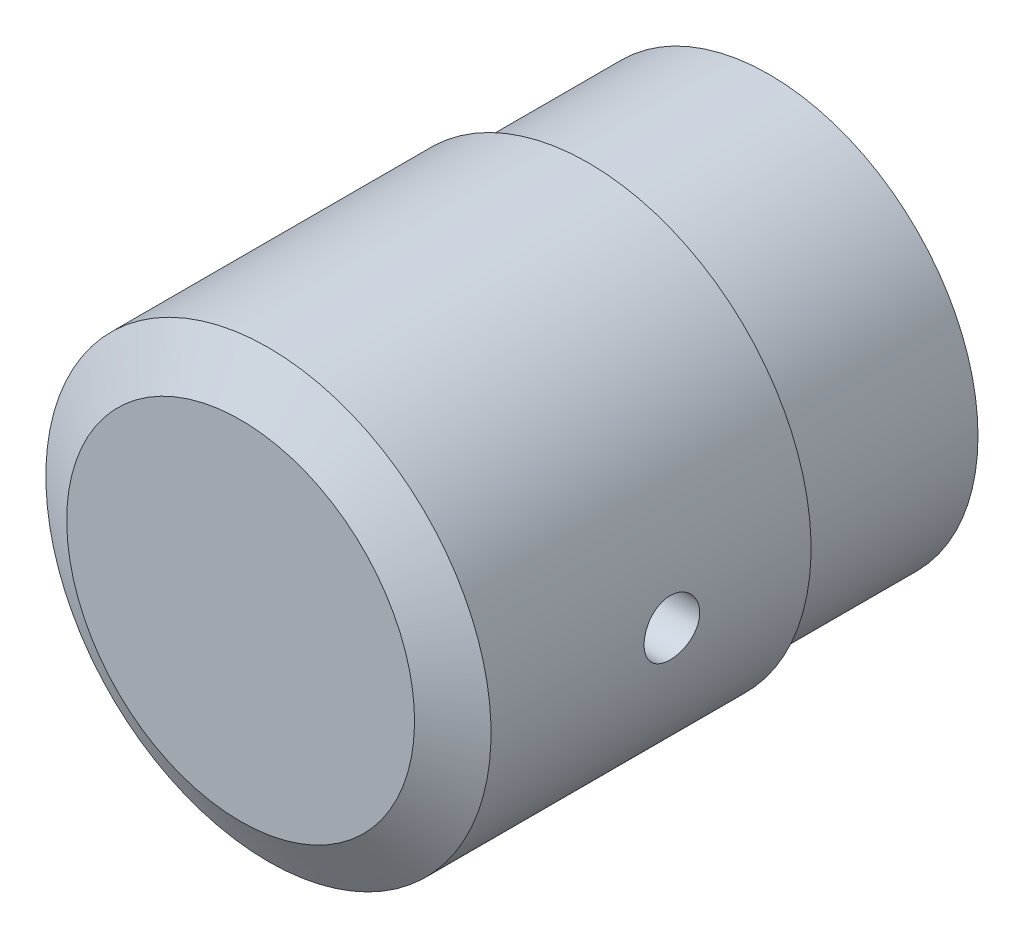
ISO-10303-21;
HEADER;
FILE_DESCRIPTION(('STEP AP214'),'2;1');
FILE_NAME('part.step','',(''),(''),'','','');
FILE_SCHEMA(('AUTOMOTIVE_DESIGN { 1 0 10303 214 1 1 1 1 }'));
ENDSEC;
DATA;
#1=APPLICATION_CONTEXT('core data for automotive mechanical design processes');
#2=APPLICATION_PROTOCOL_DEFINITION('international standard','automotive_design',2000,#1);
#3=PRODUCT_CONTEXT('',#1,'mechanical');
#4=PRODUCT('Part','Part','',(#3));
#5=PRODUCT_RELATED_PRODUCT_CATEGORY('part','',(#4));
#6=PRODUCT_DEFINITION_FORMATION('','',#4);
#7=PRODUCT_DEFINITION_CONTEXT('part definition',#1,'design');
#8=PRODUCT_DEFINITION('design','',#6,#7);
#9=PRODUCT_DEFINITION_SHAPE('','',#8);
#10=(LENGTH_UNIT() NAMED_UNIT(*) SI_UNIT(.MILLI.,.METRE.));
#11=(NAMED_UNIT(*) PLANE_ANGLE_UNIT() SI_UNIT($,.RADIAN.));
#12=(NAMED_UNIT(*) SI_UNIT($,.STERADIAN.) SOLID_ANGLE_UNIT());
#13=UNCERTAINTY_MEASURE_WITH_UNIT(LENGTH_MEASURE(1.E-05),#10,'distance_accuracy_value','');
#14=(GEOMETRIC_REPRESENTATION_CONTEXT(3) GLOBAL_UNCERTAINTY_ASSIGNED_CONTEXT((#13)) GLOBAL_UNIT_ASSIGNED_CONTEXT((#10,
#11,#12)) REPRESENTATION_CONTEXT('',''));
#15=CARTESIAN_POINT('',(0.,0.,0.));
#16=DIRECTION('',(0.,0.,1.));
#17=DIRECTION('',(1.,0.,0.));
#18=AXIS2_PLACEMENT_3D('',#15,#16,#17);
#19=CARTESIAN_POINT('',(0.,0.,0.832147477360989));
#20=DIRECTION('',(0.,0.,-1.));
#21=DIRECTION('',(0.,-1.,0.));
#22=AXIS2_PLACEMENT_3D('',#19,#20,#21);
#23=CYLINDRICAL_SURFACE('',#22,16.);
#24=CARTESIAN_POINT('',(0.,0.,13.));
#25=DIRECTION('',(0.,0.,-1.));
#26=DIRECTION('',(0.,-1.,0.));
#27=AXIS2_PLACEMENT_3D('',#24,#25,#26);
#28=CIRCLE('',#27,16.);
#29=CARTESIAN_POINT('',(0.,-16.,13.));
#30=VERTEX_POINT('',#29);
#31=EDGE_CURVE('E29',#30,#30,#28,.T.);
#32=ORIENTED_EDGE('',*,*,#31,.F.);
#33=EDGE_LOOP('',(#32));
#34=FACE_BOUND('',#33,.T.);
#35=CARTESIAN_POINT('',(0.,0.,36.));
#36=DIRECTION('',(0.,0.,-1.));
#37=DIRECTION('',(0.,-1.,0.));
#38=AXIS2_PLACEMENT_3D('',#35,#36,#37);
#39=CIRCLE('',#38,16.);
#40=CARTESIAN_POINT('',(0.,-16.,36.));
#41=VERTEX_POINT('',#40);
#42=EDGE_CURVE('E25',#41,#41,#39,.T.);
#43=ORIENTED_EDGE('',*,*,#42,.T.);
#44=EDGE_LOOP('',(#43));
#45=FACE_BOUND('',#44,.T.);
#46=CARTESIAN_POINT('',(15.8745078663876,2.,23.));
#47=CARTESIAN_POINT('',(15.8745094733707,1.99999524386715,22.8881309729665));
#48=CARTESIAN_POINT('',(15.8757031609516,1.990582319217,22.7761920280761));
#49=CARTESIAN_POINT('',(15.8803471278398,1.95318113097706,22.5554294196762));
#50=CARTESIAN_POINT('',(15.8837997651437,1.92517345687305,22.4466091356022));
#51=CARTESIAN_POINT('',(15.8925645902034,1.85142135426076,22.235312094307));
#52=CARTESIAN_POINT('',(15.8978755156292,1.80568896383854,22.1328310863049));
#53=CARTESIAN_POINT('',(15.9097569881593,1.69781135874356,21.9370172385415));
#54=CARTESIAN_POINT('',(15.9163273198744,1.63566894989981,21.8436828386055));
#55=CARTESIAN_POINT('',(15.9300284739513,1.49636276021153,21.6682702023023));
#56=CARTESIAN_POINT('',(15.9371619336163,1.41912545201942,21.5862505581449));
#57=CARTESIAN_POINT('',(15.9511618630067,1.25198020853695,21.4363017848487));
#58=CARTESIAN_POINT('',(15.9580283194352,1.1620716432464,21.3683733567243));
#59=CARTESIAN_POINT('',(15.9707475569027,0.971767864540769,21.2483251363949));
#60=CARTESIAN_POINT('',(15.9765969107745,0.871338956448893,21.1962583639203));
#61=CARTESIAN_POINT('',(15.9865938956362,0.663077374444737,21.1097510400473));
#62=CARTESIAN_POINT('',(15.9907415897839,0.55524497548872,21.0753098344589));
#63=CARTESIAN_POINT('',(15.99684934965,0.335836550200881,21.0252063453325));
#64=CARTESIAN_POINT('',(15.9988207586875,0.224283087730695,21.0094466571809));
#65=CARTESIAN_POINT('',(16.0003925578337,9.85605492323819E-05,20.9968516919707));
#66=CARTESIAN_POINT('',(15.9999930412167,-0.112532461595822,21.000015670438));
#67=CARTESIAN_POINT('',(15.9968771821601,-0.335012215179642,21.0251001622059));
#68=CARTESIAN_POINT('',(15.9941737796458,-0.444872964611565,21.0469159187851));
#69=CARTESIAN_POINT('',(15.9867684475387,-0.659361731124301,21.108520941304));
#70=CARTESIAN_POINT('',(15.9820664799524,-0.763989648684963,21.1483105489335));
#71=CARTESIAN_POINT('',(15.9711700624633,-0.965367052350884,21.2448451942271));
#72=CARTESIAN_POINT('',(15.9649716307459,-1.06209458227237,21.3016355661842));
#73=CARTESIAN_POINT('',(15.9517757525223,-1.24468596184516,21.4305266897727));
#74=CARTESIAN_POINT('',(15.9447782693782,-1.33054931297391,21.5026281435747));
#75=CARTESIAN_POINT('',(15.9307109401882,-1.48959042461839,21.6606814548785));
#76=CARTESIAN_POINT('',(15.9236409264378,-1.56267747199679,21.7467246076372));
#77=CARTESIAN_POINT('',(15.9102725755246,-1.69338628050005,21.929905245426));
#78=CARTESIAN_POINT('',(15.9039742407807,-1.75100799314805,22.0270427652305));
#79=CARTESIAN_POINT('',(15.8928624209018,-1.84915565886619,22.22973559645));
#80=CARTESIAN_POINT('',(15.888049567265,-1.88967434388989,22.3352944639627));
#81=CARTESIAN_POINT('',(15.8804659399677,-1.9523853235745,22.5517915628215));
#82=CARTESIAN_POINT('',(15.8776950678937,-1.9745785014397,22.6627295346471));
#83=CARTESIAN_POINT('',(15.8745271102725,-1.99988834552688,22.8860345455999));
#84=CARTESIAN_POINT('',(15.874114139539,-2.00313267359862,22.9983868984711));
#85=CARTESIAN_POINT('',(15.8756667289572,-1.99078956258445,23.2220335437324));
#86=CARTESIAN_POINT('',(15.8776322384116,-1.97520252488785,23.3333278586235));
#87=CARTESIAN_POINT('',(15.8837058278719,-1.92574662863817,23.5513166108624));
#88=CARTESIAN_POINT('',(15.8878066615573,-1.89193958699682,23.6580252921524));
#89=CARTESIAN_POINT('',(15.8976829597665,-1.80706697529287,23.8642593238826));
#90=CARTESIAN_POINT('',(15.9034584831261,-1.75600079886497,23.9637844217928));
#91=CARTESIAN_POINT('',(15.9160714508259,-1.63774561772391,24.1534037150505));
#92=CARTESIAN_POINT('',(15.9229143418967,-1.57047289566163,24.2434453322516));
#93=CARTESIAN_POINT('',(15.9368739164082,-1.42183259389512,24.4110052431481));
#94=CARTESIAN_POINT('',(15.9439906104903,-1.34046446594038,24.4885230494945));
#95=CARTESIAN_POINT('',(15.9577447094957,-1.16538542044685,24.6292833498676));
#96=CARTESIAN_POINT('',(15.9643791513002,-1.07160679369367,24.692441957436));
#97=CARTESIAN_POINT('',(15.9763769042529,-0.874698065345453,24.8021105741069));
#98=CARTESIAN_POINT('',(15.9817402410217,-0.771568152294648,24.8486209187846));
#99=CARTESIAN_POINT('',(15.9905783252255,-0.559163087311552,24.9235342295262));
#100=CARTESIAN_POINT('',(15.9940581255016,-0.44990525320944,24.9519856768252));
#101=CARTESIAN_POINT('',(15.9987580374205,-0.228116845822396,24.9901312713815));
#102=CARTESIAN_POINT('',(15.9999782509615,-0.115586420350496,24.9998262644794));
#103=CARTESIAN_POINT('',(16.0000210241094,0.108733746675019,25.0001679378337));
#104=CARTESIAN_POINT('',(15.9988598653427,0.220523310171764,24.9909439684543));
#105=CARTESIAN_POINT('',(15.9943027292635,0.440950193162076,24.9539835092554));
#106=CARTESIAN_POINT('',(15.9909067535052,0.549587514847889,24.9262470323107));
#107=CARTESIAN_POINT('',(15.9822598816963,0.760609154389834,24.8530895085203));
#108=CARTESIAN_POINT('',(15.9770096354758,0.862995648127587,24.8076746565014));
#109=CARTESIAN_POINT('',(15.9652355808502,1.05871466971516,24.700462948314));
#110=CARTESIAN_POINT('',(15.958711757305,1.15204708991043,24.6386658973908));
#111=CARTESIAN_POINT('',(15.9450655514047,1.32766941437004,24.4999654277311));
#112=CARTESIAN_POINT('',(15.9379395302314,1.40988303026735,24.4229657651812));
#113=CARTESIAN_POINT('',(15.9239212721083,1.56027289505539,24.256245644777));
#114=CARTESIAN_POINT('',(15.917029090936,1.62844581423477,24.1665221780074));
#115=CARTESIAN_POINT('',(15.9042304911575,1.74904419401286,23.9765040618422));
#116=CARTESIAN_POINT('',(15.8983279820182,1.8014078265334,23.876169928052));
#117=CARTESIAN_POINT('',(15.888222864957,1.88846823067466,23.6681146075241));
#118=CARTESIAN_POINT('',(15.8840184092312,1.92318421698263,23.5604016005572));
#119=CARTESIAN_POINT('',(15.8788062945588,1.96565271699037,23.376776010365));
#120=CARTESIAN_POINT('',(15.8772024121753,1.97851442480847,23.3020216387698));
#121=CARTESIAN_POINT('',(15.8750526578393,1.99568964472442,23.1515222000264));
#122=CARTESIAN_POINT('',(15.8745067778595,2.00000322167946,23.0757771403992));
#123=CARTESIAN_POINT('',(15.8745078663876,2.,23.));
#124=B_SPLINE_CURVE_WITH_KNOTS('',3,(#46,#47,#48,#49,#50,#51,#52,#53,#54,#55,#56,#57,#58,#59,
#60,#61,#62,#63,#64,#65,#66,#67,#68,#69,#70,#71,#72,#73,#74,#75,#76,#77,#78,#79,#80,#81,#82,#83,
#84,#85,#86,#87,#88,#89,#90,#91,#92,#93,#94,#95,#96,#97,#98,#99,#100,#101,#102,#103,#104,#105,
#106,#107,#108,#109,#110,#111,#112,#113,#114,#115,#116,#117,#118,#119,#120,#121,#122,#123),
.UNSPECIFIED.,.T.,.F.,(4,2,2,2,2,2,2,2,2,2,2,2,2,2,2,2,2,2,2,2,2,2,2,2,2,2,2,2,2,2,2,2,2,2,2,2,
2,2,4),(0.,0.335330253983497,0.671011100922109,1.00646436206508,1.34186030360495,
1.67893262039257,2.01602170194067,2.35422548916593,2.69241672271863,3.02883677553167,
3.36524359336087,3.6997733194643,4.03430940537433,4.36974563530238,4.70519725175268,
5.04294157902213,5.38068696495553,5.71857573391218,6.05644821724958,6.39204174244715,
6.72762811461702,7.06208301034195,7.39654965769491,7.73278255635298,8.06902853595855,
8.40719108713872,8.74534682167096,9.0825908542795,9.41981967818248,9.75475053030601,
10.0896811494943,10.4244945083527,10.7593118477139,11.0963210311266,11.4334100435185,
11.7718007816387,12.1098222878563,12.3369679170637,12.5641118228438),.UNSPECIFIED.);
#125=CARTESIAN_POINT('',(15.8745078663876,2.,23.));
#126=VERTEX_POINT('',#125);
#127=EDGE_CURVE('E52',#126,#126,#124,.T.);
#128=ORIENTED_EDGE('',*,*,#127,.T.);
#129=EDGE_LOOP('',(#128));
#130=FACE_BOUND('',#129,.T.);
#131=ADVANCED_FACE('F12',(#34,#45,#130),#23,.T.);
#132=CARTESIAN_POINT('',(0.,0.,30.));
#133=DIRECTION('',(0.,0.,-1.));
#134=DIRECTION('',(0.,-1.,0.));
#135=AXIS2_PLACEMENT_3D('',#132,#133,#134);
#136=CYLINDRICAL_SURFACE('',#135,4.);
#137=CARTESIAN_POINT('',(0.,0.,13.));
#138=DIRECTION('',(0.,0.,-1.));
#139=DIRECTION('',(0.,-1.,0.));
#140=AXIS2_PLACEMENT_3D('',#137,#138,#139);
#141=CIRCLE('',#140,4.);
#142=CARTESIAN_POINT('',(0.,-4.,13.));
#143=VERTEX_POINT('',#142);
#144=EDGE_CURVE('E49',#143,#143,#141,.T.);
#145=ORIENTED_EDGE('',*,*,#144,.T.);
#146=EDGE_LOOP('',(#145));
#147=FACE_BOUND('',#146,.T.);
#148=CARTESIAN_POINT('',(0.,0.,30.));
#149=DIRECTION('',(0.,0.,-1.));
#150=DIRECTION('',(0.,-1.,0.));
#151=AXIS2_PLACEMENT_3D('',#148,#149,#150);
#152=CIRCLE('',#151,4.);
#153=CARTESIAN_POINT('',(0.,-4.,30.));
#154=VERTEX_POINT('',#153);
#155=EDGE_CURVE('E46',#154,#154,#152,.T.);
#156=ORIENTED_EDGE('',*,*,#155,.F.);
#157=EDGE_LOOP('',(#156));
#158=FACE_BOUND('',#157,.T.);
#159=CARTESIAN_POINT('',(3.4641016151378,2.,23.));
#160=CARTESIAN_POINT('',(3.46411185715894,1.99999158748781,22.8957867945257));
#161=CARTESIAN_POINT('',(3.46887633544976,1.99179963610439,22.7914378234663));
#162=CARTESIAN_POINT('',(3.48724701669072,1.95944672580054,22.5859448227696));
#163=CARTESIAN_POINT('',(3.50087179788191,1.93525221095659,22.4848079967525));
#164=CARTESIAN_POINT('',(3.53498701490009,1.87219981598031,22.2890968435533));
#165=CARTESIAN_POINT('',(3.55544089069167,1.83341988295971,22.1944907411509));
#166=CARTESIAN_POINT('',(3.60085327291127,1.74253507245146,22.013151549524));
#167=CARTESIAN_POINT('',(3.62581202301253,1.69042947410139,21.9264188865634));
#168=CARTESIAN_POINT('',(3.67993738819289,1.569333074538,21.7553885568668));
#169=CARTESIAN_POINT('',(3.70928127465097,1.49930407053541,21.6718817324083));
#170=CARTESIAN_POINT('',(3.76743965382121,1.34650761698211,21.5171832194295));
#171=CARTESIAN_POINT('',(3.79625387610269,1.26373385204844,21.4459976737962));
#172=CARTESIAN_POINT('',(3.85242953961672,1.08097912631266,21.3132656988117));
#173=CARTESIAN_POINT('',(3.87956212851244,0.980214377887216,21.2526924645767));
#174=CARTESIAN_POINT('',(3.92701512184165,0.768314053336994,21.1497182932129));
#175=CARTESIAN_POINT('',(3.94733982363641,0.657185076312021,21.1073058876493));
#176=CARTESIAN_POINT('',(3.97760922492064,0.43608988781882,21.044990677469));
#177=CARTESIAN_POINT('',(3.98818960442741,0.326603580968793,21.0237009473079));
#178=CARTESIAN_POINT('',(4.00015167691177,0.105141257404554,20.9996677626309));
#179=CARTESIAN_POINT('',(4.00153893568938,-0.00683321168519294,20.9969130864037));
#180=CARTESIAN_POINT('',(3.99525963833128,-0.219665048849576,21.0094933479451));
#181=CARTESIAN_POINT('',(3.98836991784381,-0.320642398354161,21.0232760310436));
#182=CARTESIAN_POINT('',(3.96748490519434,-0.518627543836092,21.0657616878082));
#183=CARTESIAN_POINT('',(3.95348908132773,-0.615635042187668,21.0944657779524));
#184=CARTESIAN_POINT('',(3.91943166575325,-0.804618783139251,21.1661651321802));
#185=CARTESIAN_POINT('',(3.89928883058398,-0.896506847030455,21.2093526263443));
#186=CARTESIAN_POINT('',(3.85475291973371,-1.07195360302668,21.3085268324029));
#187=CARTESIAN_POINT('',(3.83035832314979,-1.15550929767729,21.3645181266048));
#188=CARTESIAN_POINT('',(3.77688788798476,-1.32034732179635,21.4937907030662));
#189=CARTESIAN_POINT('',(3.74758751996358,-1.40066815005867,21.5682060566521));
#190=CARTESIAN_POINT('',(3.68908681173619,-1.54820874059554,21.7291794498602));
#191=CARTESIAN_POINT('',(3.65988656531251,-1.61541842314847,21.8157467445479));
#192=CARTESIAN_POINT('',(3.60288312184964,-1.73901066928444,22.005296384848));
#193=CARTESIAN_POINT('',(3.57528639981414,-1.79443462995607,22.1089720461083));
#194=CARTESIAN_POINT('',(3.52750900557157,-1.88663822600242,22.3258753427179));
#195=CARTESIAN_POINT('',(3.50732060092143,-1.92343731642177,22.4390928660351));
#196=CARTESIAN_POINT('',(3.47889271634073,-1.97436042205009,22.6624290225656));
#197=CARTESIAN_POINT('',(3.46983311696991,-1.99005024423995,22.7720822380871));
#198=CARTESIAN_POINT('',(3.4623583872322,-2.00303389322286,22.9928026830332));
#199=CARTESIAN_POINT('',(3.46393573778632,-2.00034071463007,23.1038688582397));
#200=CARTESIAN_POINT('',(3.47668673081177,-1.97807208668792,23.3113078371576));
#201=CARTESIAN_POINT('',(3.48679175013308,-1.96037563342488,23.4079589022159));
#202=CARTESIAN_POINT('',(3.51388043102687,-1.91139256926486,23.5967355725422));
#203=CARTESIAN_POINT('',(3.53086632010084,-1.88010155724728,23.6888597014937));
#204=CARTESIAN_POINT('',(3.5707244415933,-1.80329517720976,23.8708226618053));
#205=CARTESIAN_POINT('',(3.59383286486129,-1.7571881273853,23.9603580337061));
#206=CARTESIAN_POINT('',(3.64312238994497,-1.65257412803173,24.130938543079));
#207=CARTESIAN_POINT('',(3.66930506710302,-1.59406080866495,24.2119792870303));
#208=CARTESIAN_POINT('',(3.72575996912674,-1.45767433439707,24.3739575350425));
#209=CARTESIAN_POINT('',(3.75613166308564,-1.37829054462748,24.4535943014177));
#210=CARTESIAN_POINT('',(3.81468469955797,-1.20680899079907,24.5988244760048));
#211=CARTESIAN_POINT('',(3.84286530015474,-1.11470694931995,24.6644131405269));
#212=CARTESIAN_POINT('',(3.89482723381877,-0.917070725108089,24.7811474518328));
#213=CARTESIAN_POINT('',(3.91847283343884,-0.811246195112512,24.8318662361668));
#214=CARTESIAN_POINT('',(3.95766709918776,-0.591044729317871,24.9142758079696));
#215=CARTESIAN_POINT('',(3.97322287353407,-0.476675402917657,24.945983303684));
#216=CARTESIAN_POINT('',(3.99335016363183,-0.253959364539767,24.9867371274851));
#217=CARTESIAN_POINT('',(3.9987985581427,-0.146022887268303,24.9975957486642));
#218=CARTESIAN_POINT('',(4.00084260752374,0.070251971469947,25.0016865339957));
#219=CARTESIAN_POINT('',(3.99744136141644,0.17859019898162,24.9949248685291));
#220=CARTESIAN_POINT('',(3.9826793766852,0.385075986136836,24.9651671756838));
#221=CARTESIAN_POINT('',(3.97185789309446,0.483424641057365,24.943270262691));
#222=CARTESIAN_POINT('',(3.94384187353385,0.674891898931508,24.8853460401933));
#223=CARTESIAN_POINT('',(3.92664642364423,0.768009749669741,24.8493167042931));
#224=CARTESIAN_POINT('',(3.88651861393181,0.95084683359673,24.7625457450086));
#225=CARTESIAN_POINT('',(3.86337234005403,1.04025036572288,24.7112407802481));
#226=CARTESIAN_POINT('',(3.81376266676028,1.20954920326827,24.5960847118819));
#227=CARTESIAN_POINT('',(3.78729774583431,1.28944011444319,24.5322278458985));
#228=CARTESIAN_POINT('',(3.73057218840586,1.44582833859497,24.3864033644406));
#229=CARTESIAN_POINT('',(3.70019591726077,1.52119665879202,24.3032658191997));
#230=CARTESIAN_POINT('',(3.64126158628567,1.65732528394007,24.1251077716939));
#231=CARTESIAN_POINT('',(3.61270515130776,1.71807266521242,24.0300768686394));
#232=CARTESIAN_POINT('',(3.55999186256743,1.8248671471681,23.8266911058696));
#233=CARTESIAN_POINT('',(3.53600256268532,1.87038902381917,23.7180100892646));
#234=CARTESIAN_POINT('',(3.50696218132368,1.92395929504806,23.5494218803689));
#235=CARTESIAN_POINT('',(3.49844389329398,1.93935666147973,23.4923521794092));
#236=CARTESIAN_POINT('',(3.48406059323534,1.96508069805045,23.3767674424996));
#237=CARTESIAN_POINT('',(3.4781937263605,1.97541091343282,23.3182534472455));
#238=CARTESIAN_POINT('',(3.47059023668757,1.98872932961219,23.2163992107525));
#239=CARTESIAN_POINT('',(3.46816389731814,1.99295091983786,23.1732669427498));
#240=CARTESIAN_POINT('',(3.46491740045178,1.99858810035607,23.086764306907));
#241=CARTESIAN_POINT('',(3.46409735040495,2.00000350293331,23.0433939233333));
#242=CARTESIAN_POINT('',(3.4641016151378,2.,23.));
#243=B_SPLINE_CURVE_WITH_KNOTS('',3,(#159,#160,#161,#162,#163,#164,#165,#166,#167,#168,#169,
#170,#171,#172,#173,#174,#175,#176,#177,#178,#179,#180,#181,#182,#183,#184,#185,#186,#187,#188,
#189,#190,#191,#192,#193,#194,#195,#196,#197,#198,#199,#200,#201,#202,#203,#204,#205,#206,#207,
#208,#209,#210,#211,#212,#213,#214,#215,#216,#217,#218,#219,#220,#221,#222,#223,#224,#225,#226,
#227,#228,#229,#230,#231,#232,#233,#234,#235,#236,#237,#238,#239,#240,#241,#242),.UNSPECIFIED.,
.T.,.F.,(4,2,2,2,2,2,2,2,2,2,2,2,2,2,2,2,2,2,2,2,2,2,2,2,2,2,2,2,2,2,2,2,2,2,2,2,2,2,2,2,2,4),
(0.,0.312464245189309,0.625585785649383,0.937057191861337,1.24854545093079,1.58572462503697,
1.92307142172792,2.28315784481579,2.64301653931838,2.97726969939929,3.31132047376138,
3.61632194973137,3.92134625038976,4.23059069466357,4.53994598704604,4.87854382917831,
5.21740096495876,5.57777683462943,5.93777548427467,6.26924581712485,6.60048186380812,
6.89548366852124,7.19058104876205,7.49934592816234,7.80826972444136,8.1561348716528,
8.50411729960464,8.86128362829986,9.21813559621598,9.54224540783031,9.86624173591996,
10.1688884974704,10.4715786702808,10.78721501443,11.1029966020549,11.450204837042,
11.7977188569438,12.1562149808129,12.3351395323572,12.5139387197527,12.6440387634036,
12.7741475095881),.UNSPECIFIED.);
#244=CARTESIAN_POINT('',(3.4641016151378,2.,23.));
#245=VERTEX_POINT('',#244);
#246=EDGE_CURVE('E16',#245,#245,#243,.T.);
#247=ORIENTED_EDGE('',*,*,#246,.F.);
#248=EDGE_LOOP('',(#247));
#249=FACE_BOUND('',#248,.T.);
#250=ADVANCED_FACE('F70',(#147,#158,#249),#136,.F.);
#251=CARTESIAN_POINT('',(12.5,0.,38.));
#252=DIRECTION('',(0.,0.,1.));
#253=DIRECTION('',(0.,1.,0.));
#254=AXIS2_PLACEMENT_3D('',#251,#252,#253);
#255=PLANE('',#254);
#256=CARTESIAN_POINT('',(0.,0.,38.));
#257=DIRECTION('',(0.,0.,-1.));
#258=DIRECTION('',(0.,-1.,0.));
#259=AXIS2_PLACEMENT_3D('',#256,#257,#258);
#260=CIRCLE('',#259,12.5);
#261=CARTESIAN_POINT('',(0.,-12.5,38.));
#262=VERTEX_POINT('',#261);
#263=EDGE_CURVE('E8',#262,#262,#260,.T.);
#264=ORIENTED_EDGE('',*,*,#263,.F.);
#265=EDGE_LOOP('',(#264));
#266=FACE_BOUND('',#265,.T.);
#267=ADVANCED_FACE('F14',(#266),#255,.T.);
#268=CARTESIAN_POINT('',(0.,0.,38.));
#269=DIRECTION('',(0.,0.,-1.));
#270=DIRECTION('',(0.,-1.,0.));
#271=AXIS2_PLACEMENT_3D('',#268,#269,#270);
#272=CONICAL_SURFACE('',#271,12.5,1.05165021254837);
#273=ORIENTED_EDGE('',*,*,#42,.F.);
#274=EDGE_LOOP('',(#273));
#275=FACE_BOUND('',#274,.T.);
#276=ORIENTED_EDGE('',*,*,#263,.T.);
#277=EDGE_LOOP('',(#276));
#278=FACE_BOUND('',#277,.T.);
#279=ADVANCED_FACE('F91',(#275,#278),#272,.T.);
#280=CARTESIAN_POINT('',(15.,0.,13.));
#281=DIRECTION('',(0.,0.,-1.));
#282=DIRECTION('',(0.,-1.,0.));
#283=AXIS2_PLACEMENT_3D('',#280,#281,#282);
#284=PLANE('',#283);
#285=ORIENTED_EDGE('',*,*,#31,.T.);
#286=EDGE_LOOP('',(#285));
#287=FACE_BOUND('',#286,.T.);
#288=CARTESIAN_POINT('',(0.,0.,13.));
#289=DIRECTION('',(0.,0.,-1.));
#290=DIRECTION('',(0.,-1.,0.));
#291=AXIS2_PLACEMENT_3D('',#288,#289,#290);
#292=CIRCLE('',#291,15.);
#293=CARTESIAN_POINT('',(0.,-15.,13.));
#294=VERTEX_POINT('',#293);
#295=EDGE_CURVE('E34',#294,#294,#292,.T.);
#296=ORIENTED_EDGE('',*,*,#295,.F.);
#297=EDGE_LOOP('',(#296));
#298=FACE_BOUND('',#297,.T.);
#299=ADVANCED_FACE('F88',(#287,#298),#284,.T.);
#300=CARTESIAN_POINT('',(0.,0.,0.832147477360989));
#301=DIRECTION('',(0.,0.,-1.));
#302=DIRECTION('',(0.,-1.,0.));
#303=AXIS2_PLACEMENT_3D('',#300,#301,#302);
#304=CYLINDRICAL_SURFACE('',#303,15.);
#305=CARTESIAN_POINT('',(0.,0.,0.));
#306=DIRECTION('',(0.,0.,-1.));
#307=DIRECTION('',(0.,-1.,0.));
#308=AXIS2_PLACEMENT_3D('',#305,#306,#307);
#309=CIRCLE('',#308,15.);
#310=CARTESIAN_POINT('',(0.,-15.,0.));
#311=VERTEX_POINT('',#310);
#312=EDGE_CURVE('E37',#311,#311,#309,.T.);
#313=ORIENTED_EDGE('',*,*,#312,.F.);
#314=EDGE_LOOP('',(#313));
#315=FACE_BOUND('',#314,.T.);
#316=ORIENTED_EDGE('',*,*,#295,.T.);
#317=EDGE_LOOP('',(#316));
#318=FACE_BOUND('',#317,.T.);
#319=ADVANCED_FACE('F85',(#315,#318),#304,.T.);
#320=CARTESIAN_POINT('',(15.,0.,0.));
#321=DIRECTION('',(0.,0.,1.));
#322=DIRECTION('',(0.,1.,0.));
#323=AXIS2_PLACEMENT_3D('',#320,#321,#322);
#324=PLANE('',#323);
#325=CARTESIAN_POINT('',(0.,0.,0.));
#326=DIRECTION('',(0.,0.,-1.));
#327=DIRECTION('',(0.,-1.,0.));
#328=AXIS2_PLACEMENT_3D('',#325,#326,#327);
#329=CIRCLE('',#328,12.5);
#330=CARTESIAN_POINT('',(0.,-12.5,0.));
#331=VERTEX_POINT('',#330);
#332=EDGE_CURVE('E40',#331,#331,#329,.T.);
#333=ORIENTED_EDGE('',*,*,#332,.F.);
#334=EDGE_LOOP('',(#333));
#335=FACE_BOUND('',#334,.T.);
#336=ORIENTED_EDGE('',*,*,#312,.T.);
#337=EDGE_LOOP('',(#336));
#338=FACE_BOUND('',#337,.T.);
#339=ADVANCED_FACE('F81',(#335,#338),#324,.F.);
#340=CARTESIAN_POINT('',(0.,0.,0.832147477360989));
#341=DIRECTION('',(0.,0.,-1.));
#342=DIRECTION('',(0.,-1.,0.));
#343=AXIS2_PLACEMENT_3D('',#340,#341,#342);
#344=CYLINDRICAL_SURFACE('',#343,12.5);
#345=CARTESIAN_POINT('',(0.,0.,13.));
#346=DIRECTION('',(0.,0.,-1.));
#347=DIRECTION('',(0.,-1.,0.));
#348=AXIS2_PLACEMENT_3D('',#345,#346,#347);
#349=CIRCLE('',#348,12.5);
#350=CARTESIAN_POINT('',(0.,-12.5,13.));
#351=VERTEX_POINT('',#350);
#352=EDGE_CURVE('E43',#351,#351,#349,.T.);
#353=ORIENTED_EDGE('',*,*,#352,.F.);
#354=EDGE_LOOP('',(#353));
#355=FACE_BOUND('',#354,.T.);
#356=ORIENTED_EDGE('',*,*,#332,.T.);
#357=EDGE_LOOP('',(#356));
#358=FACE_BOUND('',#357,.T.);
#359=ADVANCED_FACE('F77',(#355,#358),#344,.F.);
#360=CARTESIAN_POINT('',(0.,0.,13.));
#361=DIRECTION('',(0.,0.,-1.));
#362=DIRECTION('',(0.,-1.,0.));
#363=AXIS2_PLACEMENT_3D('',#360,#361,#362);
#364=PLANE('',#363);
#365=ORIENTED_EDGE('',*,*,#144,.F.);
#366=EDGE_LOOP('',(#365));
#367=FACE_BOUND('',#366,.T.);
#368=ORIENTED_EDGE('',*,*,#352,.T.);
#369=EDGE_LOOP('',(#368));
#370=FACE_BOUND('',#369,.T.);
#371=ADVANCED_FACE('F68',(#367,#370),#364,.T.);
#372=CARTESIAN_POINT('',(0.,0.,30.));
#373=DIRECTION('',(0.,0.,-1.));
#374=DIRECTION('',(0.,-1.,0.));
#375=AXIS2_PLACEMENT_3D('',#372,#373,#374);
#376=PLANE('',#375);
#377=ORIENTED_EDGE('',*,*,#155,.T.);
#378=EDGE_LOOP('',(#377));
#379=FACE_BOUND('',#378,.T.);
#380=ADVANCED_FACE('F64',(#379),#376,.T.);
#381=CARTESIAN_POINT('',(3.,0.,23.));
#382=DIRECTION('',(1.,0.,0.));
#383=DIRECTION('',(0.,1.,0.));
#384=AXIS2_PLACEMENT_3D('',#381,#382,#383);
#385=CYLINDRICAL_SURFACE('',#384,2.);
#386=ORIENTED_EDGE('',*,*,#127,.F.);
#387=EDGE_LOOP('',(#386));
#388=FACE_BOUND('',#387,.T.);
#389=ORIENTED_EDGE('',*,*,#246,.T.);
#390=EDGE_LOOP('',(#389));
#391=FACE_BOUND('',#390,.T.);
#392=ADVANCED_FACE('F60',(#388,#391),#385,.F.);
#393=CLOSED_SHELL('',(#131,#250,#267,#279,#299,#319,#339,#359,#371,#380,#392));
#394=MANIFOLD_SOLID_BREP('B1',#393);
#395=ADVANCED_BREP_SHAPE_REPRESENTATION('',(#18,#394),#14);
#396=SHAPE_DEFINITION_REPRESENTATION(#9,#395);
ENDSEC;
END-ISO-10303-21;
